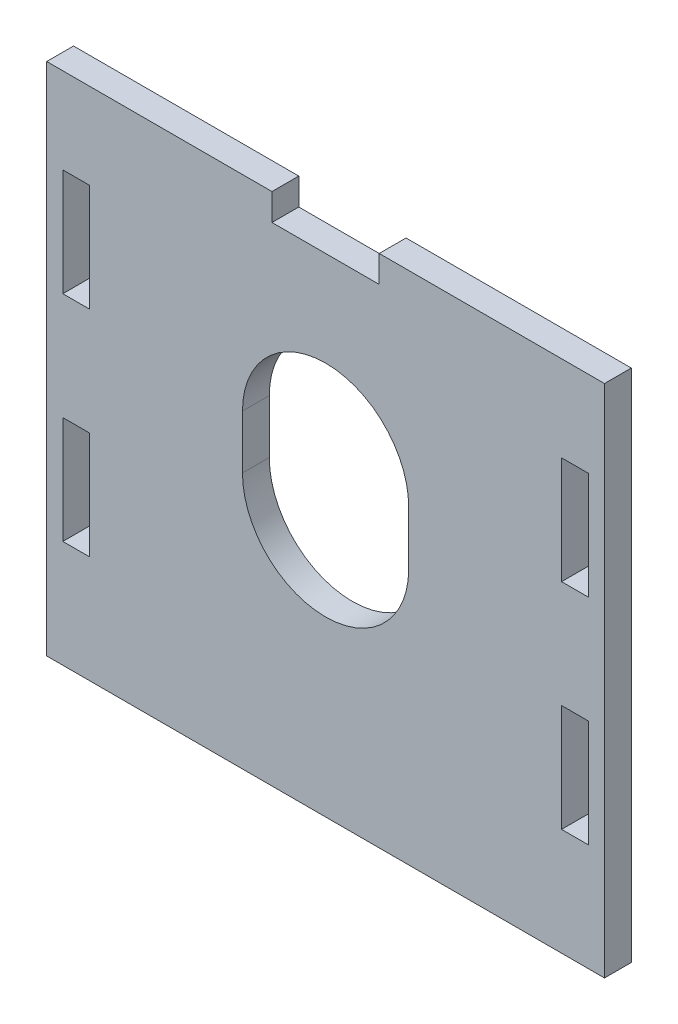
ISO-10303-21;
HEADER;
FILE_DESCRIPTION(('STEP AP214'),'2;1');
FILE_NAME('part.step','',(''),(''),'','','');
FILE_SCHEMA(('AUTOMOTIVE_DESIGN { 1 0 10303 214 1 1 1 1 }'));
ENDSEC;
DATA;
#1=APPLICATION_CONTEXT('core data for automotive mechanical design processes');
#2=APPLICATION_PROTOCOL_DEFINITION('international standard','automotive_design',2000,#1);
#3=PRODUCT_CONTEXT('',#1,'mechanical');
#4=PRODUCT('Part','Part','',(#3));
#5=PRODUCT_RELATED_PRODUCT_CATEGORY('part','',(#4));
#6=PRODUCT_DEFINITION_FORMATION('','',#4);
#7=PRODUCT_DEFINITION_CONTEXT('part definition',#1,'design');
#8=PRODUCT_DEFINITION('design','',#6,#7);
#9=PRODUCT_DEFINITION_SHAPE('','',#8);
#10=(LENGTH_UNIT() NAMED_UNIT(*) SI_UNIT(.MILLI.,.METRE.));
#11=(NAMED_UNIT(*) PLANE_ANGLE_UNIT() SI_UNIT($,.RADIAN.));
#12=(NAMED_UNIT(*) SI_UNIT($,.STERADIAN.) SOLID_ANGLE_UNIT());
#13=UNCERTAINTY_MEASURE_WITH_UNIT(LENGTH_MEASURE(1.E-05),#10,'distance_accuracy_value','');
#14=(GEOMETRIC_REPRESENTATION_CONTEXT(3) GLOBAL_UNCERTAINTY_ASSIGNED_CONTEXT((#13)) GLOBAL_UNIT_ASSIGNED_CONTEXT((#10,
#11,#12)) REPRESENTATION_CONTEXT('',''));
#15=CARTESIAN_POINT('',(0.,0.,0.));
#16=DIRECTION('',(0.,0.,1.));
#17=DIRECTION('',(1.,0.,0.));
#18=AXIS2_PLACEMENT_3D('',#15,#16,#17);
#19=CARTESIAN_POINT('',(-26.,48.,2.5));
#20=DIRECTION('',(0.,-1.,0.));
#21=DIRECTION('',(0.,0.,-1.));
#22=AXIS2_PLACEMENT_3D('',#19,#20,#21);
#23=PLANE('',#22);
#24=DIRECTION('',(-1.,0.,0.));
#25=VECTOR('',#24,1.);
#26=CARTESIAN_POINT('',(-26.,48.,0.));
#27=LINE('',#26,#25);
#28=CARTESIAN_POINT('',(26.,48.,0.));
#29=VERTEX_POINT('',#28);
#30=CARTESIAN_POINT('',(5.,48.,0.));
#31=VERTEX_POINT('',#30);
#32=EDGE_CURVE('E410',#29,#31,#27,.T.);
#33=ORIENTED_EDGE('',*,*,#32,.T.);
#34=DIRECTION('',(0.,0.,1.));
#35=VECTOR('',#34,1.);
#36=CARTESIAN_POINT('',(5.,48.,-10.3077640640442));
#37=LINE('',#36,#35);
#38=CARTESIAN_POINT('',(5.,48.,2.5));
#39=VERTEX_POINT('',#38);
#40=EDGE_CURVE('E231',#31,#39,#37,.T.);
#41=ORIENTED_EDGE('',*,*,#40,.T.);
#42=DIRECTION('',(-1.,0.,0.));
#43=VECTOR('',#42,1.);
#44=CARTESIAN_POINT('',(-26.,48.,2.5));
#45=LINE('',#44,#43);
#46=CARTESIAN_POINT('',(26.,48.,2.5));
#47=VERTEX_POINT('',#46);
#48=EDGE_CURVE('E387',#47,#39,#45,.T.);
#49=ORIENTED_EDGE('',*,*,#48,.F.);
#50=DIRECTION('',(0.,0.,-1.));
#51=VECTOR('',#50,1.);
#52=CARTESIAN_POINT('',(26.,48.,2.5));
#53=LINE('',#52,#51);
#54=EDGE_CURVE('E436',#47,#29,#53,.T.);
#55=ORIENTED_EDGE('',*,*,#54,.T.);
#56=EDGE_LOOP('',(#33,#41,#49,#55));
#57=FACE_BOUND('',#56,.T.);
#58=ADVANCED_FACE('F40',(#57),#23,.F.);
#59=CARTESIAN_POINT('',(-26.,0.,2.5));
#60=DIRECTION('',(1.,0.,0.));
#61=DIRECTION('',(0.,0.,-1.));
#62=AXIS2_PLACEMENT_3D('',#59,#60,#61);
#63=PLANE('',#62);
#64=DIRECTION('',(0.,-1.,0.));
#65=VECTOR('',#64,1.);
#66=CARTESIAN_POINT('',(-26.,0.,0.));
#67=LINE('',#66,#65);
#68=CARTESIAN_POINT('',(-26.,48.,0.));
#69=VERTEX_POINT('',#68);
#70=CARTESIAN_POINT('',(-26.,0.,0.));
#71=VERTEX_POINT('',#70);
#72=EDGE_CURVE('E397',#69,#71,#67,.T.);
#73=ORIENTED_EDGE('',*,*,#72,.T.);
#74=DIRECTION('',(0.,0.,-1.));
#75=VECTOR('',#74,1.);
#76=CARTESIAN_POINT('',(-26.,0.,2.5));
#77=LINE('',#76,#75);
#78=CARTESIAN_POINT('',(-26.,0.,2.5));
#79=VERTEX_POINT('',#78);
#80=EDGE_CURVE('E12',#79,#71,#77,.T.);
#81=ORIENTED_EDGE('',*,*,#80,.F.);
#82=DIRECTION('',(0.,-1.,0.));
#83=VECTOR('',#82,1.);
#84=CARTESIAN_POINT('',(-26.,0.,2.5));
#85=LINE('',#84,#83);
#86=CARTESIAN_POINT('',(-26.,48.,2.5));
#87=VERTEX_POINT('',#86);
#88=EDGE_CURVE('E404',#87,#79,#85,.T.);
#89=ORIENTED_EDGE('',*,*,#88,.F.);
#90=DIRECTION('',(0.,0.,-1.));
#91=VECTOR('',#90,1.);
#92=CARTESIAN_POINT('',(-26.,48.,2.5));
#93=LINE('',#92,#91);
#94=EDGE_CURVE('E392',#87,#69,#93,.T.);
#95=ORIENTED_EDGE('',*,*,#94,.T.);
#96=EDGE_LOOP('',(#73,#81,#89,#95));
#97=FACE_BOUND('',#96,.T.);
#98=ADVANCED_FACE('F42',(#97),#63,.F.);
#99=CARTESIAN_POINT('',(-26.,0.,2.5));
#100=DIRECTION('',(0.,1.,0.));
#101=DIRECTION('',(0.,0.,1.));
#102=AXIS2_PLACEMENT_3D('',#99,#100,#101);
#103=PLANE('',#102);
#104=DIRECTION('',(1.,0.,0.));
#105=VECTOR('',#104,1.);
#106=CARTESIAN_POINT('',(-26.,0.,0.));
#107=LINE('',#106,#105);
#108=CARTESIAN_POINT('',(26.,0.,0.));
#109=VERTEX_POINT('',#108);
#110=EDGE_CURVE('E440',#71,#109,#107,.T.);
#111=ORIENTED_EDGE('',*,*,#110,.T.);
#112=DIRECTION('',(0.,0.,-1.));
#113=VECTOR('',#112,1.);
#114=CARTESIAN_POINT('',(26.,0.,2.5));
#115=LINE('',#114,#113);
#116=CARTESIAN_POINT('',(26.,0.,2.5));
#117=VERTEX_POINT('',#116);
#118=EDGE_CURVE('E48',#117,#109,#115,.T.);
#119=ORIENTED_EDGE('',*,*,#118,.F.);
#120=DIRECTION('',(1.,0.,0.));
#121=VECTOR('',#120,1.);
#122=CARTESIAN_POINT('',(-26.,0.,2.5));
#123=LINE('',#122,#121);
#124=EDGE_CURVE('E409',#79,#117,#123,.T.);
#125=ORIENTED_EDGE('',*,*,#124,.F.);
#126=ORIENTED_EDGE('',*,*,#80,.T.);
#127=EDGE_LOOP('',(#111,#119,#125,#126));
#128=FACE_BOUND('',#127,.T.);
#129=ADVANCED_FACE('F439',(#128),#103,.F.);
#130=CARTESIAN_POINT('',(26.,0.,2.5));
#131=DIRECTION('',(-1.,0.,0.));
#132=DIRECTION('',(0.,0.,1.));
#133=AXIS2_PLACEMENT_3D('',#130,#131,#132);
#134=PLANE('',#133);
#135=DIRECTION('',(0.,1.,0.));
#136=VECTOR('',#135,1.);
#137=CARTESIAN_POINT('',(26.,0.,0.));
#138=LINE('',#137,#136);
#139=EDGE_CURVE('E447',#109,#29,#138,.T.);
#140=ORIENTED_EDGE('',*,*,#139,.T.);
#141=ORIENTED_EDGE('',*,*,#54,.F.);
#142=DIRECTION('',(0.,1.,0.));
#143=VECTOR('',#142,1.);
#144=CARTESIAN_POINT('',(26.,0.,2.5));
#145=LINE('',#144,#143);
#146=EDGE_CURVE('E394',#117,#47,#145,.T.);
#147=ORIENTED_EDGE('',*,*,#146,.F.);
#148=ORIENTED_EDGE('',*,*,#118,.T.);
#149=EDGE_LOOP('',(#140,#141,#147,#148));
#150=FACE_BOUND('',#149,.T.);
#151=ADVANCED_FACE('F444',(#150),#134,.F.);
#152=CARTESIAN_POINT('',(-5.,48.,2.5));
#153=VERTEX_POINT('',#152);
#154=EDGE_CURVE('E393',#153,#87,#45,.T.);
#155=ORIENTED_EDGE('',*,*,#154,.F.);
#156=DIRECTION('',(0.,0.,1.));
#157=VECTOR('',#156,1.);
#158=CARTESIAN_POINT('',(-5.,48.,-10.3077640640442));
#159=LINE('',#158,#157);
#160=CARTESIAN_POINT('',(-5.,48.,0.));
#161=VERTEX_POINT('',#160);
#162=EDGE_CURVE('E258',#161,#153,#159,.T.);
#163=ORIENTED_EDGE('',*,*,#162,.F.);
#164=EDGE_CURVE('E432',#161,#69,#27,.T.);
#165=ORIENTED_EDGE('',*,*,#164,.T.);
#166=ORIENTED_EDGE('',*,*,#94,.F.);
#167=EDGE_LOOP('',(#155,#163,#165,#166));
#168=FACE_BOUND('',#167,.T.);
#169=ADVANCED_FACE('F431',(#168),#23,.F.);
#170=CARTESIAN_POINT('',(0.,0.,2.5));
#171=DIRECTION('',(0.,0.,-1.));
#172=DIRECTION('',(-1.,0.,0.));
#173=AXIS2_PLACEMENT_3D('',#170,#171,#172);
#174=PLANE('',#173);
#175=CARTESIAN_POINT('',(0.,23.9,2.5));
#176=DIRECTION('',(0.,0.,1.));
#177=DIRECTION('',(1.,0.,0.));
#178=AXIS2_PLACEMENT_3D('',#175,#176,#177);
#179=CIRCLE('',#178,7.75);
#180=CARTESIAN_POINT('',(-7.75,23.9,2.5));
#181=VERTEX_POINT('',#180);
#182=CARTESIAN_POINT('',(7.75,23.9,2.5));
#183=VERTEX_POINT('',#182);
#184=EDGE_CURVE('E268',#181,#183,#179,.T.);
#185=ORIENTED_EDGE('',*,*,#184,.F.);
#186=DIRECTION('',(0.,-1.,0.));
#187=VECTOR('',#186,1.);
#188=CARTESIAN_POINT('',(-7.75,28.9,2.5));
#189=LINE('',#188,#187);
#190=CARTESIAN_POINT('',(-7.75,28.9,2.5));
#191=VERTEX_POINT('',#190);
#192=EDGE_CURVE('E769',#191,#181,#189,.T.);
#193=ORIENTED_EDGE('',*,*,#192,.F.);
#194=CARTESIAN_POINT('',(0.,28.9,2.5));
#195=DIRECTION('',(0.,0.,1.));
#196=DIRECTION('',(1.,0.,0.));
#197=AXIS2_PLACEMENT_3D('',#194,#195,#196);
#198=CIRCLE('',#197,7.75);
#199=CARTESIAN_POINT('',(7.75,28.9,2.5));
#200=VERTEX_POINT('',#199);
#201=EDGE_CURVE('E263',#200,#191,#198,.T.);
#202=ORIENTED_EDGE('',*,*,#201,.F.);
#203=DIRECTION('',(0.,1.,0.));
#204=VECTOR('',#203,1.);
#205=CARTESIAN_POINT('',(7.75,28.9,2.5));
#206=LINE('',#205,#204);
#207=EDGE_CURVE('E63',#183,#200,#206,.T.);
#208=ORIENTED_EDGE('',*,*,#207,.F.);
#209=EDGE_LOOP('',(#185,#193,#202,#208));
#210=FACE_BOUND('',#209,.T.);
#211=DIRECTION('',(0.,1.,0.));
#212=VECTOR('',#211,1.);
#213=CARTESIAN_POINT('',(24.5,20.,2.5));
#214=LINE('',#213,#212);
#215=CARTESIAN_POINT('',(24.5,10.,2.5));
#216=VERTEX_POINT('',#215);
#217=CARTESIAN_POINT('',(24.5,20.,2.5));
#218=VERTEX_POINT('',#217);
#219=EDGE_CURVE('E280',#216,#218,#214,.T.);
#220=ORIENTED_EDGE('',*,*,#219,.F.);
#221=DIRECTION('',(1.,0.,0.));
#222=VECTOR('',#221,1.);
#223=CARTESIAN_POINT('',(22.,10.,2.5));
#224=LINE('',#223,#222);
#225=CARTESIAN_POINT('',(22.,10.,2.5));
#226=VERTEX_POINT('',#225);
#227=EDGE_CURVE('E286',#226,#216,#224,.T.);
#228=ORIENTED_EDGE('',*,*,#227,.F.);
#229=DIRECTION('',(0.,-1.,0.));
#230=VECTOR('',#229,1.);
#231=CARTESIAN_POINT('',(22.,20.,2.5));
#232=LINE('',#231,#230);
#233=CARTESIAN_POINT('',(22.,20.,2.5));
#234=VERTEX_POINT('',#233);
#235=EDGE_CURVE('E293',#234,#226,#232,.T.);
#236=ORIENTED_EDGE('',*,*,#235,.F.);
#237=DIRECTION('',(-1.,0.,0.));
#238=VECTOR('',#237,1.);
#239=CARTESIAN_POINT('',(22.,20.,2.5));
#240=LINE('',#239,#238);
#241=EDGE_CURVE('E285',#218,#234,#240,.T.);
#242=ORIENTED_EDGE('',*,*,#241,.F.);
#243=EDGE_LOOP('',(#220,#228,#236,#242));
#244=FACE_BOUND('',#243,.T.);
#245=DIRECTION('',(1.,0.,0.));
#246=VECTOR('',#245,1.);
#247=CARTESIAN_POINT('',(-22.,10.,2.5));
#248=LINE('',#247,#246);
#249=CARTESIAN_POINT('',(-24.5,10.,2.5));
#250=VERTEX_POINT('',#249);
#251=CARTESIAN_POINT('',(-22.,10.,2.5));
#252=VERTEX_POINT('',#251);
#253=EDGE_CURVE('E307',#250,#252,#248,.T.);
#254=ORIENTED_EDGE('',*,*,#253,.F.);
#255=DIRECTION('',(0.,-1.,0.));
#256=VECTOR('',#255,1.);
#257=CARTESIAN_POINT('',(-24.5,20.,2.5));
#258=LINE('',#257,#256);
#259=CARTESIAN_POINT('',(-24.5,20.,2.5));
#260=VERTEX_POINT('',#259);
#261=EDGE_CURVE('E313',#260,#250,#258,.T.);
#262=ORIENTED_EDGE('',*,*,#261,.F.);
#263=DIRECTION('',(-1.,0.,0.));
#264=VECTOR('',#263,1.);
#265=CARTESIAN_POINT('',(-22.,20.,2.5));
#266=LINE('',#265,#264);
#267=CARTESIAN_POINT('',(-22.,20.,2.5));
#268=VERTEX_POINT('',#267);
#269=EDGE_CURVE('E320',#268,#260,#266,.T.);
#270=ORIENTED_EDGE('',*,*,#269,.F.);
#271=DIRECTION('',(0.,1.,0.));
#272=VECTOR('',#271,1.);
#273=CARTESIAN_POINT('',(-22.,20.,2.5));
#274=LINE('',#273,#272);
#275=EDGE_CURVE('E312',#252,#268,#274,.T.);
#276=ORIENTED_EDGE('',*,*,#275,.F.);
#277=EDGE_LOOP('',(#254,#262,#270,#276));
#278=FACE_BOUND('',#277,.T.);
#279=DIRECTION('',(1.,0.,0.));
#280=VECTOR('',#279,1.);
#281=CARTESIAN_POINT('',(-22.,30.,2.5));
#282=LINE('',#281,#280);
#283=CARTESIAN_POINT('',(-24.5,30.,2.5));
#284=VERTEX_POINT('',#283);
#285=CARTESIAN_POINT('',(-22.,30.,2.5));
#286=VERTEX_POINT('',#285);
#287=EDGE_CURVE('E334',#284,#286,#282,.T.);
#288=ORIENTED_EDGE('',*,*,#287,.F.);
#289=DIRECTION('',(0.,-1.,0.));
#290=VECTOR('',#289,1.);
#291=CARTESIAN_POINT('',(-24.5,40.,2.5));
#292=LINE('',#291,#290);
#293=CARTESIAN_POINT('',(-24.5,40.,2.5));
#294=VERTEX_POINT('',#293);
#295=EDGE_CURVE('E340',#294,#284,#292,.T.);
#296=ORIENTED_EDGE('',*,*,#295,.F.);
#297=DIRECTION('',(-1.,0.,0.));
#298=VECTOR('',#297,1.);
#299=CARTESIAN_POINT('',(-22.,40.,2.5));
#300=LINE('',#299,#298);
#301=CARTESIAN_POINT('',(-22.,40.,2.5));
#302=VERTEX_POINT('',#301);
#303=EDGE_CURVE('E347',#302,#294,#300,.T.);
#304=ORIENTED_EDGE('',*,*,#303,.F.);
#305=DIRECTION('',(0.,1.,0.));
#306=VECTOR('',#305,1.);
#307=CARTESIAN_POINT('',(-22.,40.,2.5));
#308=LINE('',#307,#306);
#309=EDGE_CURVE('E339',#286,#302,#308,.T.);
#310=ORIENTED_EDGE('',*,*,#309,.F.);
#311=EDGE_LOOP('',(#288,#296,#304,#310));
#312=FACE_BOUND('',#311,.T.);
#313=DIRECTION('',(0.,1.,0.));
#314=VECTOR('',#313,1.);
#315=CARTESIAN_POINT('',(24.5,40.,2.5));
#316=LINE('',#315,#314);
#317=CARTESIAN_POINT('',(24.5,30.,2.5));
#318=VERTEX_POINT('',#317);
#319=CARTESIAN_POINT('',(24.5,40.,2.5));
#320=VERTEX_POINT('',#319);
#321=EDGE_CURVE('E361',#318,#320,#316,.T.);
#322=ORIENTED_EDGE('',*,*,#321,.F.);
#323=DIRECTION('',(1.,0.,0.));
#324=VECTOR('',#323,1.);
#325=CARTESIAN_POINT('',(22.,30.,2.5));
#326=LINE('',#325,#324);
#327=CARTESIAN_POINT('',(22.,30.,2.5));
#328=VERTEX_POINT('',#327);
#329=EDGE_CURVE('E367',#328,#318,#326,.T.);
#330=ORIENTED_EDGE('',*,*,#329,.F.);
#331=DIRECTION('',(0.,-1.,0.));
#332=VECTOR('',#331,1.);
#333=CARTESIAN_POINT('',(22.,40.,2.5));
#334=LINE('',#333,#332);
#335=CARTESIAN_POINT('',(22.,40.,2.5));
#336=VERTEX_POINT('',#335);
#337=EDGE_CURVE('E374',#336,#328,#334,.T.);
#338=ORIENTED_EDGE('',*,*,#337,.F.);
#339=DIRECTION('',(-1.,0.,0.));
#340=VECTOR('',#339,1.);
#341=CARTESIAN_POINT('',(22.,40.,2.5));
#342=LINE('',#341,#340);
#343=EDGE_CURVE('E366',#320,#336,#342,.T.);
#344=ORIENTED_EDGE('',*,*,#343,.F.);
#345=EDGE_LOOP('',(#322,#330,#338,#344));
#346=FACE_BOUND('',#345,.T.);
#347=ORIENTED_EDGE('',*,*,#48,.T.);
#348=DIRECTION('',(0.,1.,0.));
#349=VECTOR('',#348,1.);
#350=CARTESIAN_POINT('',(5.,48.,2.5));
#351=LINE('',#350,#349);
#352=CARTESIAN_POINT('',(5.,45.5,2.5));
#353=VERTEX_POINT('',#352);
#354=EDGE_CURVE('E249',#353,#39,#351,.T.);
#355=ORIENTED_EDGE('',*,*,#354,.F.);
#356=DIRECTION('',(1.,0.,0.));
#357=VECTOR('',#356,1.);
#358=CARTESIAN_POINT('',(-5.,45.5,2.5));
#359=LINE('',#358,#357);
#360=CARTESIAN_POINT('',(-5.,45.5,2.5));
#361=VERTEX_POINT('',#360);
#362=EDGE_CURVE('E242',#361,#353,#359,.T.);
#363=ORIENTED_EDGE('',*,*,#362,.F.);
#364=DIRECTION('',(0.,-1.,0.));
#365=VECTOR('',#364,1.);
#366=CARTESIAN_POINT('',(-5.,48.,2.5));
#367=LINE('',#366,#365);
#368=EDGE_CURVE('E255',#153,#361,#367,.T.);
#369=ORIENTED_EDGE('',*,*,#368,.F.);
#370=ORIENTED_EDGE('',*,*,#154,.T.);
#371=ORIENTED_EDGE('',*,*,#88,.T.);
#372=ORIENTED_EDGE('',*,*,#124,.T.);
#373=ORIENTED_EDGE('',*,*,#146,.T.);
#374=EDGE_LOOP('',(#347,#355,#363,#369,#370,#371,#372,#373));
#375=FACE_BOUND('',#374,.T.);
#376=ADVANCED_FACE('F425',(#210,#244,#278,#312,#346,#375),#174,.F.);
#377=CARTESIAN_POINT('',(0.,0.,0.));
#378=DIRECTION('',(0.,0.,-1.));
#379=DIRECTION('',(-1.,0.,0.));
#380=AXIS2_PLACEMENT_3D('',#377,#378,#379);
#381=PLANE('',#380);
#382=DIRECTION('',(0.,1.,0.));
#383=VECTOR('',#382,1.);
#384=CARTESIAN_POINT('',(5.,48.,0.));
#385=LINE('',#384,#383);
#386=CARTESIAN_POINT('',(5.,45.5,0.));
#387=VERTEX_POINT('',#386);
#388=EDGE_CURVE('E225',#387,#31,#385,.T.);
#389=ORIENTED_EDGE('',*,*,#388,.T.);
#390=ORIENTED_EDGE('',*,*,#32,.F.);
#391=ORIENTED_EDGE('',*,*,#139,.F.);
#392=ORIENTED_EDGE('',*,*,#110,.F.);
#393=ORIENTED_EDGE('',*,*,#72,.F.);
#394=ORIENTED_EDGE('',*,*,#164,.F.);
#395=DIRECTION('',(0.,-1.,0.));
#396=VECTOR('',#395,1.);
#397=CARTESIAN_POINT('',(-5.,48.,0.));
#398=LINE('',#397,#396);
#399=CARTESIAN_POINT('',(-5.,45.5,0.));
#400=VERTEX_POINT('',#399);
#401=EDGE_CURVE('E248',#161,#400,#398,.T.);
#402=ORIENTED_EDGE('',*,*,#401,.T.);
#403=DIRECTION('',(1.,0.,0.));
#404=VECTOR('',#403,1.);
#405=CARTESIAN_POINT('',(-5.,45.5,0.));
#406=LINE('',#405,#404);
#407=EDGE_CURVE('E239',#400,#387,#406,.T.);
#408=ORIENTED_EDGE('',*,*,#407,.T.);
#409=EDGE_LOOP('',(#389,#390,#391,#392,#393,#394,#402,#408));
#410=FACE_BOUND('',#409,.T.);
#411=DIRECTION('',(0.,-1.,0.));
#412=VECTOR('',#411,1.);
#413=CARTESIAN_POINT('',(-7.75,28.9,0.));
#414=LINE('',#413,#412);
#415=CARTESIAN_POINT('',(-7.75,28.9,0.));
#416=VERTEX_POINT('',#415);
#417=CARTESIAN_POINT('',(-7.75,23.9,0.));
#418=VERTEX_POINT('',#417);
#419=EDGE_CURVE('E267',#416,#418,#414,.T.);
#420=ORIENTED_EDGE('',*,*,#419,.T.);
#421=CARTESIAN_POINT('',(0.,23.9,0.));
#422=DIRECTION('',(0.,0.,-1.));
#423=DIRECTION('',(-1.,0.,0.));
#424=AXIS2_PLACEMENT_3D('',#421,#422,#423);
#425=CIRCLE('',#424,7.75);
#426=CARTESIAN_POINT('',(7.75,23.9,0.));
#427=VERTEX_POINT('',#426);
#428=EDGE_CURVE('E781',#418,#427,#425,.F.);
#429=ORIENTED_EDGE('',*,*,#428,.T.);
#430=DIRECTION('',(0.,1.,0.));
#431=VECTOR('',#430,1.);
#432=CARTESIAN_POINT('',(7.75,28.9,0.));
#433=LINE('',#432,#431);
#434=CARTESIAN_POINT('',(7.75,28.9,0.));
#435=VERTEX_POINT('',#434);
#436=EDGE_CURVE('E764',#427,#435,#433,.T.);
#437=ORIENTED_EDGE('',*,*,#436,.T.);
#438=CARTESIAN_POINT('',(0.,28.9,0.));
#439=DIRECTION('',(0.,0.,-1.));
#440=DIRECTION('',(-1.,0.,0.));
#441=AXIS2_PLACEMENT_3D('',#438,#439,#440);
#442=CIRCLE('',#441,7.75);
#443=EDGE_CURVE('E762',#435,#416,#442,.F.);
#444=ORIENTED_EDGE('',*,*,#443,.T.);
#445=EDGE_LOOP('',(#420,#429,#437,#444));
#446=FACE_BOUND('',#445,.T.);
#447=DIRECTION('',(1.,0.,0.));
#448=VECTOR('',#447,1.);
#449=CARTESIAN_POINT('',(22.,10.,0.));
#450=LINE('',#449,#448);
#451=CARTESIAN_POINT('',(22.,10.,0.));
#452=VERTEX_POINT('',#451);
#453=CARTESIAN_POINT('',(24.5,10.,0.));
#454=VERTEX_POINT('',#453);
#455=EDGE_CURVE('E299',#452,#454,#450,.T.);
#456=ORIENTED_EDGE('',*,*,#455,.T.);
#457=DIRECTION('',(0.,1.,0.));
#458=VECTOR('',#457,1.);
#459=CARTESIAN_POINT('',(24.5,20.,0.));
#460=LINE('',#459,#458);
#461=CARTESIAN_POINT('',(24.5,20.,0.));
#462=VERTEX_POINT('',#461);
#463=EDGE_CURVE('E833',#454,#462,#460,.T.);
#464=ORIENTED_EDGE('',*,*,#463,.T.);
#465=DIRECTION('',(-1.,0.,0.));
#466=VECTOR('',#465,1.);
#467=CARTESIAN_POINT('',(22.,20.,0.));
#468=LINE('',#467,#466);
#469=CARTESIAN_POINT('',(22.,20.,0.));
#470=VERTEX_POINT('',#469);
#471=EDGE_CURVE('E843',#462,#470,#468,.T.);
#472=ORIENTED_EDGE('',*,*,#471,.T.);
#473=DIRECTION('',(0.,-1.,0.));
#474=VECTOR('',#473,1.);
#475=CARTESIAN_POINT('',(22.,20.,0.));
#476=LINE('',#475,#474);
#477=EDGE_CURVE('E840',#470,#452,#476,.T.);
#478=ORIENTED_EDGE('',*,*,#477,.T.);
#479=EDGE_LOOP('',(#456,#464,#472,#478));
#480=FACE_BOUND('',#479,.T.);
#481=DIRECTION('',(0.,-1.,0.));
#482=VECTOR('',#481,1.);
#483=CARTESIAN_POINT('',(-24.5,20.,0.));
#484=LINE('',#483,#482);
#485=CARTESIAN_POINT('',(-24.5,20.,0.));
#486=VERTEX_POINT('',#485);
#487=CARTESIAN_POINT('',(-24.5,10.,0.));
#488=VERTEX_POINT('',#487);
#489=EDGE_CURVE('E326',#486,#488,#484,.T.);
#490=ORIENTED_EDGE('',*,*,#489,.T.);
#491=DIRECTION('',(1.,0.,0.));
#492=VECTOR('',#491,1.);
#493=CARTESIAN_POINT('',(-22.,10.,0.));
#494=LINE('',#493,#492);
#495=CARTESIAN_POINT('',(-22.,10.,0.));
#496=VERTEX_POINT('',#495);
#497=EDGE_CURVE('E858',#488,#496,#494,.T.);
#498=ORIENTED_EDGE('',*,*,#497,.T.);
#499=DIRECTION('',(0.,1.,0.));
#500=VECTOR('',#499,1.);
#501=CARTESIAN_POINT('',(-22.,20.,0.));
#502=LINE('',#501,#500);
#503=CARTESIAN_POINT('',(-22.,20.,0.));
#504=VERTEX_POINT('',#503);
#505=EDGE_CURVE('E865',#496,#504,#502,.T.);
#506=ORIENTED_EDGE('',*,*,#505,.T.);
#507=DIRECTION('',(-1.,0.,0.));
#508=VECTOR('',#507,1.);
#509=CARTESIAN_POINT('',(-22.,20.,0.));
#510=LINE('',#509,#508);
#511=EDGE_CURVE('E860',#504,#486,#510,.T.);
#512=ORIENTED_EDGE('',*,*,#511,.T.);
#513=EDGE_LOOP('',(#490,#498,#506,#512));
#514=FACE_BOUND('',#513,.T.);
#515=DIRECTION('',(0.,-1.,0.));
#516=VECTOR('',#515,1.);
#517=CARTESIAN_POINT('',(-24.5,40.,0.));
#518=LINE('',#517,#516);
#519=CARTESIAN_POINT('',(-24.5,40.,0.));
#520=VERTEX_POINT('',#519);
#521=CARTESIAN_POINT('',(-24.5,30.,0.));
#522=VERTEX_POINT('',#521);
#523=EDGE_CURVE('E353',#520,#522,#518,.T.);
#524=ORIENTED_EDGE('',*,*,#523,.T.);
#525=DIRECTION('',(1.,0.,0.));
#526=VECTOR('',#525,1.);
#527=CARTESIAN_POINT('',(-22.,30.,0.));
#528=LINE('',#527,#526);
#529=CARTESIAN_POINT('',(-22.,30.,0.));
#530=VERTEX_POINT('',#529);
#531=EDGE_CURVE('E806',#522,#530,#528,.T.);
#532=ORIENTED_EDGE('',*,*,#531,.T.);
#533=DIRECTION('',(0.,1.,0.));
#534=VECTOR('',#533,1.);
#535=CARTESIAN_POINT('',(-22.,40.,0.));
#536=LINE('',#535,#534);
#537=CARTESIAN_POINT('',(-22.,40.,0.));
#538=VERTEX_POINT('',#537);
#539=EDGE_CURVE('E822',#530,#538,#536,.T.);
#540=ORIENTED_EDGE('',*,*,#539,.T.);
#541=DIRECTION('',(-1.,0.,0.));
#542=VECTOR('',#541,1.);
#543=CARTESIAN_POINT('',(-22.,40.,0.));
#544=LINE('',#543,#542);
#545=EDGE_CURVE('E807',#538,#520,#544,.T.);
#546=ORIENTED_EDGE('',*,*,#545,.T.);
#547=EDGE_LOOP('',(#524,#532,#540,#546));
#548=FACE_BOUND('',#547,.T.);
#549=DIRECTION('',(1.,0.,0.));
#550=VECTOR('',#549,1.);
#551=CARTESIAN_POINT('',(22.,30.,0.));
#552=LINE('',#551,#550);
#553=CARTESIAN_POINT('',(22.,30.,0.));
#554=VERTEX_POINT('',#553);
#555=CARTESIAN_POINT('',(24.5,30.,0.));
#556=VERTEX_POINT('',#555);
#557=EDGE_CURVE('E380',#554,#556,#552,.T.);
#558=ORIENTED_EDGE('',*,*,#557,.T.);
#559=DIRECTION('',(0.,1.,0.));
#560=VECTOR('',#559,1.);
#561=CARTESIAN_POINT('',(24.5,40.,0.));
#562=LINE('',#561,#560);
#563=CARTESIAN_POINT('',(24.5,40.,0.));
#564=VERTEX_POINT('',#563);
#565=EDGE_CURVE('E470',#556,#564,#562,.T.);
#566=ORIENTED_EDGE('',*,*,#565,.T.);
#567=DIRECTION('',(-1.,0.,0.));
#568=VECTOR('',#567,1.);
#569=CARTESIAN_POINT('',(22.,40.,0.));
#570=LINE('',#569,#568);
#571=CARTESIAN_POINT('',(22.,40.,0.));
#572=VERTEX_POINT('',#571);
#573=EDGE_CURVE('E465',#564,#572,#570,.T.);
#574=ORIENTED_EDGE('',*,*,#573,.T.);
#575=DIRECTION('',(0.,-1.,0.));
#576=VECTOR('',#575,1.);
#577=CARTESIAN_POINT('',(22.,40.,0.));
#578=LINE('',#577,#576);
#579=EDGE_CURVE('E456',#572,#554,#578,.T.);
#580=ORIENTED_EDGE('',*,*,#579,.T.);
#581=EDGE_LOOP('',(#558,#566,#574,#580));
#582=FACE_BOUND('',#581,.T.);
#583=ADVANCED_FACE('F245',(#410,#446,#480,#514,#548,#582),#381,.T.);
#584=CARTESIAN_POINT('',(22.,30.,-10.3077640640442));
#585=DIRECTION('',(0.,-1.,0.));
#586=DIRECTION('',(0.,0.,-1.));
#587=AXIS2_PLACEMENT_3D('',#584,#585,#586);
#588=PLANE('',#587);
#589=DIRECTION('',(0.,0.,1.));
#590=VECTOR('',#589,1.);
#591=CARTESIAN_POINT('',(22.,30.,-10.3077640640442));
#592=LINE('',#591,#590);
#593=EDGE_CURVE('E411',#554,#328,#592,.T.);
#594=ORIENTED_EDGE('',*,*,#593,.T.);
#595=ORIENTED_EDGE('',*,*,#329,.T.);
#596=DIRECTION('',(0.,0.,1.));
#597=VECTOR('',#596,1.);
#598=CARTESIAN_POINT('',(24.5,30.,-10.3077640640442));
#599=LINE('',#598,#597);
#600=EDGE_CURVE('E472',#556,#318,#599,.T.);
#601=ORIENTED_EDGE('',*,*,#600,.F.);
#602=ORIENTED_EDGE('',*,*,#557,.F.);
#603=EDGE_LOOP('',(#594,#595,#601,#602));
#604=FACE_BOUND('',#603,.T.);
#605=ADVANCED_FACE('F488',(#604),#588,.F.);
#606=CARTESIAN_POINT('',(24.5,40.,-10.3077640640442));
#607=DIRECTION('',(1.,0.,0.));
#608=DIRECTION('',(0.,1.,0.));
#609=AXIS2_PLACEMENT_3D('',#606,#607,#608);
#610=PLANE('',#609);
#611=ORIENTED_EDGE('',*,*,#600,.T.);
#612=ORIENTED_EDGE('',*,*,#321,.T.);
#613=DIRECTION('',(0.,0.,1.));
#614=VECTOR('',#613,1.);
#615=CARTESIAN_POINT('',(24.5,40.,-10.3077640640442));
#616=LINE('',#615,#614);
#617=EDGE_CURVE('E469',#564,#320,#616,.T.);
#618=ORIENTED_EDGE('',*,*,#617,.F.);
#619=ORIENTED_EDGE('',*,*,#565,.F.);
#620=EDGE_LOOP('',(#611,#612,#618,#619));
#621=FACE_BOUND('',#620,.T.);
#622=ADVANCED_FACE('F490',(#621),#610,.F.);
#623=CARTESIAN_POINT('',(22.,40.,-10.3077640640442));
#624=DIRECTION('',(0.,1.,0.));
#625=DIRECTION('',(0.,0.,1.));
#626=AXIS2_PLACEMENT_3D('',#623,#624,#625);
#627=PLANE('',#626);
#628=ORIENTED_EDGE('',*,*,#617,.T.);
#629=ORIENTED_EDGE('',*,*,#343,.T.);
#630=DIRECTION('',(0.,0.,1.));
#631=VECTOR('',#630,1.);
#632=CARTESIAN_POINT('',(22.,40.,-10.3077640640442));
#633=LINE('',#632,#631);
#634=EDGE_CURVE('E460',#572,#336,#633,.T.);
#635=ORIENTED_EDGE('',*,*,#634,.F.);
#636=ORIENTED_EDGE('',*,*,#573,.F.);
#637=EDGE_LOOP('',(#628,#629,#635,#636));
#638=FACE_BOUND('',#637,.T.);
#639=ADVANCED_FACE('F480',(#638),#627,.F.);
#640=CARTESIAN_POINT('',(22.,40.,-10.3077640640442));
#641=DIRECTION('',(-1.,0.,0.));
#642=DIRECTION('',(0.,-1.,0.));
#643=AXIS2_PLACEMENT_3D('',#640,#641,#642);
#644=PLANE('',#643);
#645=ORIENTED_EDGE('',*,*,#634,.T.);
#646=ORIENTED_EDGE('',*,*,#337,.T.);
#647=ORIENTED_EDGE('',*,*,#593,.F.);
#648=ORIENTED_EDGE('',*,*,#579,.F.);
#649=EDGE_LOOP('',(#645,#646,#647,#648));
#650=FACE_BOUND('',#649,.T.);
#651=ADVANCED_FACE('F486',(#650),#644,.F.);
#652=CARTESIAN_POINT('',(-24.5,40.,-10.3077640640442));
#653=DIRECTION('',(-1.,0.,0.));
#654=DIRECTION('',(0.,-1.,0.));
#655=AXIS2_PLACEMENT_3D('',#652,#653,#654);
#656=PLANE('',#655);
#657=DIRECTION('',(0.,0.,1.));
#658=VECTOR('',#657,1.);
#659=CARTESIAN_POINT('',(-24.5,40.,-10.3077640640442));
#660=LINE('',#659,#658);
#661=EDGE_CURVE('E325',#520,#294,#660,.T.);
#662=ORIENTED_EDGE('',*,*,#661,.T.);
#663=ORIENTED_EDGE('',*,*,#295,.T.);
#664=DIRECTION('',(0.,0.,1.));
#665=VECTOR('',#664,1.);
#666=CARTESIAN_POINT('',(-24.5,30.,-10.3077640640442));
#667=LINE('',#666,#665);
#668=EDGE_CURVE('E809',#522,#284,#667,.T.);
#669=ORIENTED_EDGE('',*,*,#668,.F.);
#670=ORIENTED_EDGE('',*,*,#523,.F.);
#671=EDGE_LOOP('',(#662,#663,#669,#670));
#672=FACE_BOUND('',#671,.T.);
#673=ADVANCED_FACE('F567',(#672),#656,.F.);
#674=CARTESIAN_POINT('',(-22.,30.,-10.3077640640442));
#675=DIRECTION('',(0.,-1.,0.));
#676=DIRECTION('',(0.,0.,-1.));
#677=AXIS2_PLACEMENT_3D('',#674,#675,#676);
#678=PLANE('',#677);
#679=ORIENTED_EDGE('',*,*,#668,.T.);
#680=ORIENTED_EDGE('',*,*,#287,.T.);
#681=DIRECTION('',(0.,0.,1.));
#682=VECTOR('',#681,1.);
#683=CARTESIAN_POINT('',(-22.,30.,-10.3077640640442));
#684=LINE('',#683,#682);
#685=EDGE_CURVE('E817',#530,#286,#684,.T.);
#686=ORIENTED_EDGE('',*,*,#685,.F.);
#687=ORIENTED_EDGE('',*,*,#531,.F.);
#688=EDGE_LOOP('',(#679,#680,#686,#687));
#689=FACE_BOUND('',#688,.T.);
#690=ADVANCED_FACE('F575',(#689),#678,.F.);
#691=CARTESIAN_POINT('',(-22.,40.,-10.3077640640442));
#692=DIRECTION('',(1.,0.,0.));
#693=DIRECTION('',(0.,1.,0.));
#694=AXIS2_PLACEMENT_3D('',#691,#692,#693);
#695=PLANE('',#694);
#696=ORIENTED_EDGE('',*,*,#685,.T.);
#697=ORIENTED_EDGE('',*,*,#309,.T.);
#698=DIRECTION('',(0.,0.,1.));
#699=VECTOR('',#698,1.);
#700=CARTESIAN_POINT('',(-22.,40.,-10.3077640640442));
#701=LINE('',#700,#699);
#702=EDGE_CURVE('E815',#538,#302,#701,.T.);
#703=ORIENTED_EDGE('',*,*,#702,.F.);
#704=ORIENTED_EDGE('',*,*,#539,.F.);
#705=EDGE_LOOP('',(#696,#697,#703,#704));
#706=FACE_BOUND('',#705,.T.);
#707=ADVANCED_FACE('F584',(#706),#695,.F.);
#708=CARTESIAN_POINT('',(-22.,40.,-10.3077640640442));
#709=DIRECTION('',(0.,1.,0.));
#710=DIRECTION('',(0.,0.,1.));
#711=AXIS2_PLACEMENT_3D('',#708,#709,#710);
#712=PLANE('',#711);
#713=ORIENTED_EDGE('',*,*,#702,.T.);
#714=ORIENTED_EDGE('',*,*,#303,.T.);
#715=ORIENTED_EDGE('',*,*,#661,.F.);
#716=ORIENTED_EDGE('',*,*,#545,.F.);
#717=EDGE_LOOP('',(#713,#714,#715,#716));
#718=FACE_BOUND('',#717,.T.);
#719=ADVANCED_FACE('F593',(#718),#712,.F.);
#720=CARTESIAN_POINT('',(-24.5,20.,-10.3077640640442));
#721=DIRECTION('',(-1.,0.,0.));
#722=DIRECTION('',(0.,-1.,0.));
#723=AXIS2_PLACEMENT_3D('',#720,#721,#722);
#724=PLANE('',#723);
#725=DIRECTION('',(0.,0.,1.));
#726=VECTOR('',#725,1.);
#727=CARTESIAN_POINT('',(-24.5,20.,-10.3077640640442));
#728=LINE('',#727,#726);
#729=EDGE_CURVE('E298',#486,#260,#728,.T.);
#730=ORIENTED_EDGE('',*,*,#729,.T.);
#731=ORIENTED_EDGE('',*,*,#261,.T.);
#732=DIRECTION('',(0.,0.,1.));
#733=VECTOR('',#732,1.);
#734=CARTESIAN_POINT('',(-24.5,10.,-10.3077640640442));
#735=LINE('',#734,#733);
#736=EDGE_CURVE('E857',#488,#250,#735,.T.);
#737=ORIENTED_EDGE('',*,*,#736,.F.);
#738=ORIENTED_EDGE('',*,*,#489,.F.);
#739=EDGE_LOOP('',(#730,#731,#737,#738));
#740=FACE_BOUND('',#739,.T.);
#741=ADVANCED_FACE('F602',(#740),#724,.F.);
#742=CARTESIAN_POINT('',(-22.,10.,-10.3077640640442));
#743=DIRECTION('',(0.,-1.,0.));
#744=DIRECTION('',(0.,0.,-1.));
#745=AXIS2_PLACEMENT_3D('',#742,#743,#744);
#746=PLANE('',#745);
#747=ORIENTED_EDGE('',*,*,#736,.T.);
#748=ORIENTED_EDGE('',*,*,#253,.T.);
#749=DIRECTION('',(0.,0.,1.));
#750=VECTOR('',#749,1.);
#751=CARTESIAN_POINT('',(-22.,10.,-10.3077640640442));
#752=LINE('',#751,#750);
#753=EDGE_CURVE('E855',#496,#252,#752,.T.);
#754=ORIENTED_EDGE('',*,*,#753,.F.);
#755=ORIENTED_EDGE('',*,*,#497,.F.);
#756=EDGE_LOOP('',(#747,#748,#754,#755));
#757=FACE_BOUND('',#756,.T.);
#758=ADVANCED_FACE('F611',(#757),#746,.F.);
#759=CARTESIAN_POINT('',(-22.,20.,-10.3077640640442));
#760=DIRECTION('',(1.,0.,0.));
#761=DIRECTION('',(0.,1.,0.));
#762=AXIS2_PLACEMENT_3D('',#759,#760,#761);
#763=PLANE('',#762);
#764=ORIENTED_EDGE('',*,*,#753,.T.);
#765=ORIENTED_EDGE('',*,*,#275,.T.);
#766=DIRECTION('',(0.,0.,1.));
#767=VECTOR('',#766,1.);
#768=CARTESIAN_POINT('',(-22.,20.,-10.3077640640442));
#769=LINE('',#768,#767);
#770=EDGE_CURVE('E863',#504,#268,#769,.T.);
#771=ORIENTED_EDGE('',*,*,#770,.F.);
#772=ORIENTED_EDGE('',*,*,#505,.F.);
#773=EDGE_LOOP('',(#764,#765,#771,#772));
#774=FACE_BOUND('',#773,.T.);
#775=ADVANCED_FACE('F620',(#774),#763,.F.);
#776=CARTESIAN_POINT('',(-22.,20.,-10.3077640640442));
#777=DIRECTION('',(0.,1.,0.));
#778=DIRECTION('',(0.,0.,1.));
#779=AXIS2_PLACEMENT_3D('',#776,#777,#778);
#780=PLANE('',#779);
#781=ORIENTED_EDGE('',*,*,#770,.T.);
#782=ORIENTED_EDGE('',*,*,#269,.T.);
#783=ORIENTED_EDGE('',*,*,#729,.F.);
#784=ORIENTED_EDGE('',*,*,#511,.F.);
#785=EDGE_LOOP('',(#781,#782,#783,#784));
#786=FACE_BOUND('',#785,.T.);
#787=ADVANCED_FACE('F629',(#786),#780,.F.);
#788=CARTESIAN_POINT('',(22.,10.,-10.3077640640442));
#789=DIRECTION('',(0.,-1.,0.));
#790=DIRECTION('',(0.,0.,-1.));
#791=AXIS2_PLACEMENT_3D('',#788,#789,#790);
#792=PLANE('',#791);
#793=DIRECTION('',(0.,0.,1.));
#794=VECTOR('',#793,1.);
#795=CARTESIAN_POINT('',(22.,10.,-10.3077640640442));
#796=LINE('',#795,#794);
#797=EDGE_CURVE('E379',#452,#226,#796,.T.);
#798=ORIENTED_EDGE('',*,*,#797,.T.);
#799=ORIENTED_EDGE('',*,*,#227,.T.);
#800=DIRECTION('',(0.,0.,1.));
#801=VECTOR('',#800,1.);
#802=CARTESIAN_POINT('',(24.5,10.,-10.3077640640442));
#803=LINE('',#802,#801);
#804=EDGE_CURVE('E832',#454,#216,#803,.T.);
#805=ORIENTED_EDGE('',*,*,#804,.F.);
#806=ORIENTED_EDGE('',*,*,#455,.F.);
#807=EDGE_LOOP('',(#798,#799,#805,#806));
#808=FACE_BOUND('',#807,.T.);
#809=ADVANCED_FACE('F638',(#808),#792,.F.);
#810=CARTESIAN_POINT('',(24.5,20.,-10.3077640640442));
#811=DIRECTION('',(1.,0.,0.));
#812=DIRECTION('',(0.,1.,0.));
#813=AXIS2_PLACEMENT_3D('',#810,#811,#812);
#814=PLANE('',#813);
#815=ORIENTED_EDGE('',*,*,#804,.T.);
#816=ORIENTED_EDGE('',*,*,#219,.T.);
#817=DIRECTION('',(0.,0.,1.));
#818=VECTOR('',#817,1.);
#819=CARTESIAN_POINT('',(24.5,20.,-10.3077640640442));
#820=LINE('',#819,#818);
#821=EDGE_CURVE('E836',#462,#218,#820,.T.);
#822=ORIENTED_EDGE('',*,*,#821,.F.);
#823=ORIENTED_EDGE('',*,*,#463,.F.);
#824=EDGE_LOOP('',(#815,#816,#822,#823));
#825=FACE_BOUND('',#824,.T.);
#826=ADVANCED_FACE('F647',(#825),#814,.F.);
#827=CARTESIAN_POINT('',(22.,20.,-10.3077640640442));
#828=DIRECTION('',(0.,1.,0.));
#829=DIRECTION('',(0.,0.,1.));
#830=AXIS2_PLACEMENT_3D('',#827,#828,#829);
#831=PLANE('',#830);
#832=ORIENTED_EDGE('',*,*,#821,.T.);
#833=ORIENTED_EDGE('',*,*,#241,.T.);
#834=DIRECTION('',(0.,0.,1.));
#835=VECTOR('',#834,1.);
#836=CARTESIAN_POINT('',(22.,20.,-10.3077640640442));
#837=LINE('',#836,#835);
#838=EDGE_CURVE('E841',#470,#234,#837,.T.);
#839=ORIENTED_EDGE('',*,*,#838,.F.);
#840=ORIENTED_EDGE('',*,*,#471,.F.);
#841=EDGE_LOOP('',(#832,#833,#839,#840));
#842=FACE_BOUND('',#841,.T.);
#843=ADVANCED_FACE('F656',(#842),#831,.F.);
#844=CARTESIAN_POINT('',(22.,20.,-10.3077640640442));
#845=DIRECTION('',(-1.,0.,0.));
#846=DIRECTION('',(0.,-1.,0.));
#847=AXIS2_PLACEMENT_3D('',#844,#845,#846);
#848=PLANE('',#847);
#849=ORIENTED_EDGE('',*,*,#838,.T.);
#850=ORIENTED_EDGE('',*,*,#235,.T.);
#851=ORIENTED_EDGE('',*,*,#797,.F.);
#852=ORIENTED_EDGE('',*,*,#477,.F.);
#853=EDGE_LOOP('',(#849,#850,#851,#852));
#854=FACE_BOUND('',#853,.T.);
#855=ADVANCED_FACE('F665',(#854),#848,.F.);
#856=CARTESIAN_POINT('',(-7.75,28.9,-25.7001945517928));
#857=DIRECTION('',(-1.,0.,0.));
#858=DIRECTION('',(0.,-1.,0.));
#859=AXIS2_PLACEMENT_3D('',#856,#857,#858);
#860=PLANE('',#859);
#861=DIRECTION('',(0.,0.,1.));
#862=VECTOR('',#861,1.);
#863=CARTESIAN_POINT('',(-7.75,28.9,-25.7001945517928));
#864=LINE('',#863,#862);
#865=EDGE_CURVE('E352',#416,#191,#864,.T.);
#866=ORIENTED_EDGE('',*,*,#865,.T.);
#867=ORIENTED_EDGE('',*,*,#192,.T.);
#868=DIRECTION('',(0.,0.,1.));
#869=VECTOR('',#868,1.);
#870=CARTESIAN_POINT('',(-7.75,23.9,-25.7001945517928));
#871=LINE('',#870,#869);
#872=EDGE_CURVE('E777',#418,#181,#871,.T.);
#873=ORIENTED_EDGE('',*,*,#872,.F.);
#874=ORIENTED_EDGE('',*,*,#419,.F.);
#875=EDGE_LOOP('',(#866,#867,#873,#874));
#876=FACE_BOUND('',#875,.T.);
#877=ADVANCED_FACE('F674',(#876),#860,.F.);
#878=CARTESIAN_POINT('',(0.,23.9,-25.7001945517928));
#879=DIRECTION('',(0.,0.,1.));
#880=DIRECTION('',(1.,0.,0.));
#881=AXIS2_PLACEMENT_3D('',#878,#879,#880);
#882=CYLINDRICAL_SURFACE('',#881,7.75);
#883=ORIENTED_EDGE('',*,*,#872,.T.);
#884=ORIENTED_EDGE('',*,*,#184,.T.);
#885=DIRECTION('',(0.,0.,1.));
#886=VECTOR('',#885,1.);
#887=CARTESIAN_POINT('',(7.75,23.9,-25.7001945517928));
#888=LINE('',#887,#886);
#889=EDGE_CURVE('E780',#427,#183,#888,.T.);
#890=ORIENTED_EDGE('',*,*,#889,.F.);
#891=ORIENTED_EDGE('',*,*,#428,.F.);
#892=EDGE_LOOP('',(#883,#884,#890,#891));
#893=FACE_BOUND('',#892,.T.);
#894=ADVANCED_FACE('F683',(#893),#882,.F.);
#895=CARTESIAN_POINT('',(7.75,28.9,-25.7001945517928));
#896=DIRECTION('',(1.,0.,0.));
#897=DIRECTION('',(0.,1.,0.));
#898=AXIS2_PLACEMENT_3D('',#895,#896,#897);
#899=PLANE('',#898);
#900=ORIENTED_EDGE('',*,*,#889,.T.);
#901=ORIENTED_EDGE('',*,*,#207,.T.);
#902=DIRECTION('',(0.,0.,1.));
#903=VECTOR('',#902,1.);
#904=CARTESIAN_POINT('',(7.75,28.9,-25.7001945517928));
#905=LINE('',#904,#903);
#906=EDGE_CURVE('E758',#435,#200,#905,.T.);
#907=ORIENTED_EDGE('',*,*,#906,.F.);
#908=ORIENTED_EDGE('',*,*,#436,.F.);
#909=EDGE_LOOP('',(#900,#901,#907,#908));
#910=FACE_BOUND('',#909,.T.);
#911=ADVANCED_FACE('F692',(#910),#899,.F.);
#912=CARTESIAN_POINT('',(0.,28.9,-25.7001945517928));
#913=DIRECTION('',(0.,0.,1.));
#914=DIRECTION('',(1.,0.,0.));
#915=AXIS2_PLACEMENT_3D('',#912,#913,#914);
#916=CYLINDRICAL_SURFACE('',#915,7.75);
#917=ORIENTED_EDGE('',*,*,#906,.T.);
#918=ORIENTED_EDGE('',*,*,#201,.T.);
#919=ORIENTED_EDGE('',*,*,#865,.F.);
#920=ORIENTED_EDGE('',*,*,#443,.F.);
#921=EDGE_LOOP('',(#917,#918,#919,#920));
#922=FACE_BOUND('',#921,.T.);
#923=ADVANCED_FACE('F701',(#922),#916,.F.);
#924=CARTESIAN_POINT('',(-5.,45.5,-10.3077640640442));
#925=DIRECTION('',(0.,-1.,0.));
#926=DIRECTION('',(0.,0.,-1.));
#927=AXIS2_PLACEMENT_3D('',#924,#925,#926);
#928=PLANE('',#927);
#929=DIRECTION('',(0.,0.,1.));
#930=VECTOR('',#929,1.);
#931=CARTESIAN_POINT('',(-5.,45.5,-10.3077640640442));
#932=LINE('',#931,#930);
#933=EDGE_CURVE('E55',#400,#361,#932,.T.);
#934=ORIENTED_EDGE('',*,*,#933,.T.);
#935=ORIENTED_EDGE('',*,*,#362,.T.);
#936=DIRECTION('',(0.,0.,1.));
#937=VECTOR('',#936,1.);
#938=CARTESIAN_POINT('',(5.,45.5,-10.3077640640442));
#939=LINE('',#938,#937);
#940=EDGE_CURVE('E228',#387,#353,#939,.T.);
#941=ORIENTED_EDGE('',*,*,#940,.F.);
#942=ORIENTED_EDGE('',*,*,#407,.F.);
#943=EDGE_LOOP('',(#934,#935,#941,#942));
#944=FACE_BOUND('',#943,.T.);
#945=ADVANCED_FACE('F238',(#944),#928,.F.);
#946=CARTESIAN_POINT('',(5.,48.,-10.3077640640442));
#947=DIRECTION('',(1.,0.,0.));
#948=DIRECTION('',(0.,1.,0.));
#949=AXIS2_PLACEMENT_3D('',#946,#947,#948);
#950=PLANE('',#949);
#951=ORIENTED_EDGE('',*,*,#940,.T.);
#952=ORIENTED_EDGE('',*,*,#354,.T.);
#953=ORIENTED_EDGE('',*,*,#40,.F.);
#954=ORIENTED_EDGE('',*,*,#388,.F.);
#955=EDGE_LOOP('',(#951,#952,#953,#954));
#956=FACE_BOUND('',#955,.T.);
#957=ADVANCED_FACE('F227',(#956),#950,.F.);
#958=CARTESIAN_POINT('',(-5.,48.,-10.3077640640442));
#959=DIRECTION('',(-1.,0.,0.));
#960=DIRECTION('',(0.,-1.,0.));
#961=AXIS2_PLACEMENT_3D('',#958,#959,#960);
#962=PLANE('',#961);
#963=ORIENTED_EDGE('',*,*,#162,.T.);
#964=ORIENTED_EDGE('',*,*,#368,.T.);
#965=ORIENTED_EDGE('',*,*,#933,.F.);
#966=ORIENTED_EDGE('',*,*,#401,.F.);
#967=EDGE_LOOP('',(#963,#964,#965,#966));
#968=FACE_BOUND('',#967,.T.);
#969=ADVANCED_FACE('F453',(#968),#962,.F.);
#970=CLOSED_SHELL('',(#58,#98,#129,#151,#169,#376,#583,#605,#622,#639,#651,#673,#690,#707,#719,
#741,#758,#775,#787,#809,#826,#843,#855,#877,#894,#911,#923,#945,#957,#969));
#971=MANIFOLD_SOLID_BREP('B2',#970);
#972=ADVANCED_BREP_SHAPE_REPRESENTATION('',(#18,#971),#14);
#973=SHAPE_DEFINITION_REPRESENTATION(#9,#972);
ENDSEC;
END-ISO-10303-21;
